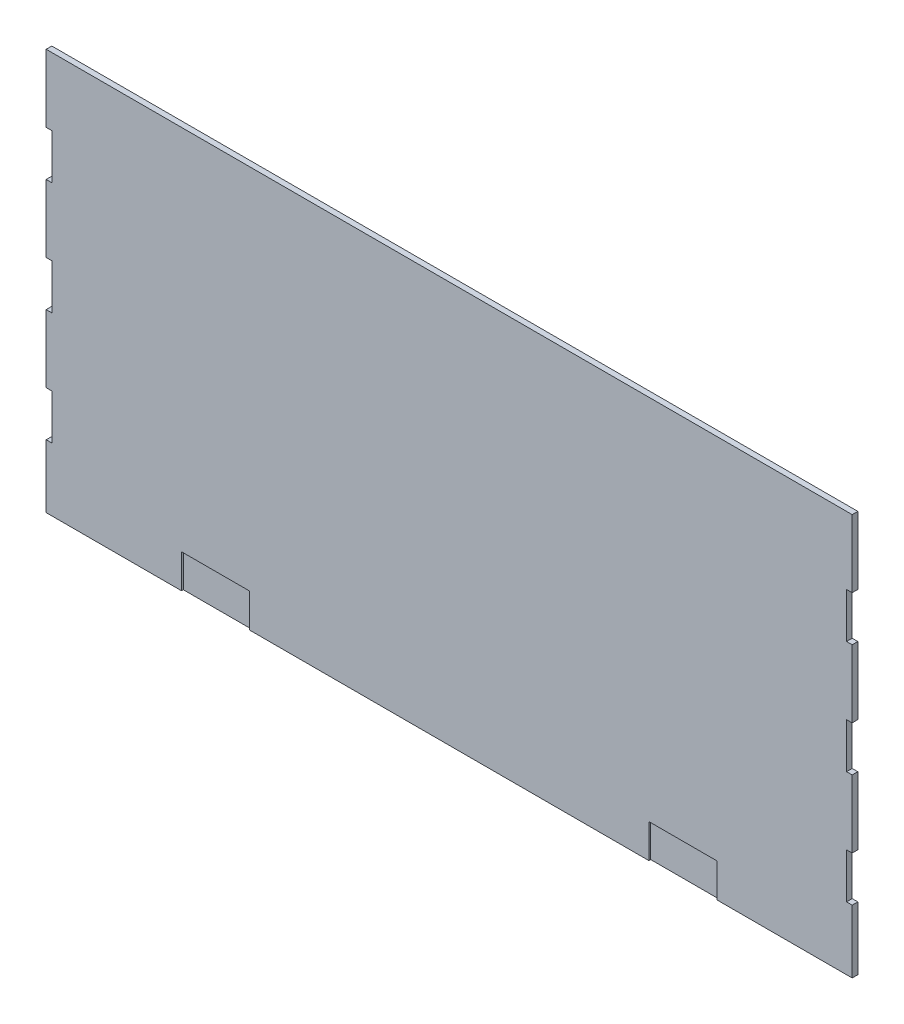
from build123d import *

# Parameters (mm, degrees)
BOSS_EXTRUDE1_DEPTH = 3.175
SKETCH2_W           = 38.354
SKETCH2_H           = 19.05
CUT_EXTRUDE1_DEPTH  = 1.016


with BuildPart() as part:
    # Sketch1 → Boss-Extrude1 (new body)
    with BuildSketch(Plane.XY):
        Polygon((0, 0), (454.025, 0), (454.025, 35.56), (450.85, 35.56), (450.85, 60.96), (454.025, 60.96), (454.025, 99.06), (450.85, 99.06), (450.85, 124.46), (454.025, 124.46), (454.025, 162.56), (450.85, 162.56), (450.85, 187.96), (454.025, 187.96), (454.025, 226.06), (0, 226.06), (0, 187.96), (3.175, 187.96), (3.175, 162.56), (0, 162.56), (0, 124.46), (3.175, 124.46), (3.175, 99.06), (0, 99.06), (0, 60.96), (3.175, 60.96), (3.175, 35.56), (0, 35.56), align=None)
    extrude(amount=BOSS_EXTRUDE1_DEPTH)

    # Sketch2 → Cut-Extrude1 (cut)
    with BuildSketch(Plane.XY.offset(3.175)):
        with Locations((95.377, 9.525)):
            Rectangle(SKETCH2_W, SKETCH2_H)
        with Locations((358.648, 9.525)):
            Rectangle(SKETCH2_W, SKETCH2_H)
    extrude(amount=-CUT_EXTRUDE1_DEPTH, mode=Mode.SUBTRACT)


solid = part.part
